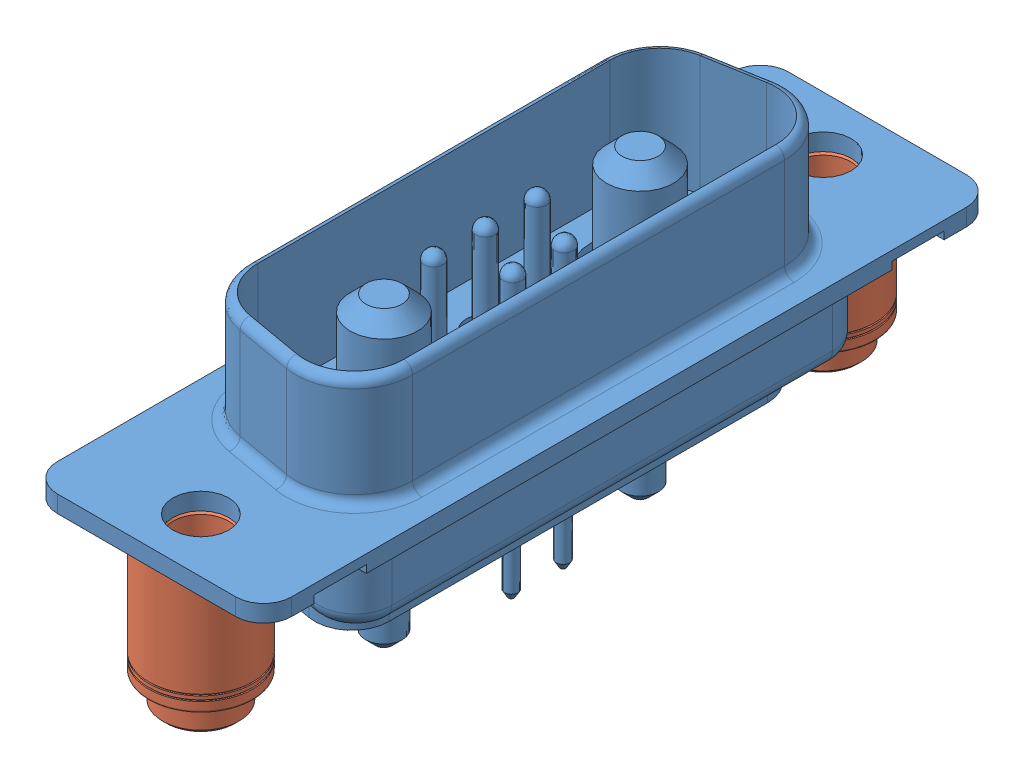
SolidWorks assembly CBD7W2 with SMT standoff.SLDASM, configuration Default (file format 11000). Lengths in mm.
Overall size (12.55 16.86 39.14).
3 component instances, 2 part files, 4 mates.
Components (placement in the parent):
- CBD7W2M35S6000-1: CBD7W2M35S6000.SLDPRT [without posts] at origin size (12.55 16.86 39.14)
- 20130118-183809-29217700-1: 20130118-183809-29217700.SLDPRT [Default] at (0 -7.874 16.6624) x (0 1 0) z (0 0 1) size (7.87 5.56 5.56)
- 20130118-183809-29217700-2: 20130118-183809-29217700.SLDPRT [Default] at (0 -7.874 -16.6624) x (0 1 0) z (0 0 1) size (7.87 5.56 5.56)
Mates (geometry in assembly coordinates):
- Coincident1: coincident: plane of CBD7W2M35S6000-1 through (4.7752 0 -18.0721) normal (0 -1 0); plane of 20130118-183809-29217700-1 through (2.7518 0 19.3603) normal (0 1 0)
- Concentric1: concentric: cylinder of CBD7W2M35S6000-1 through (0 6.9807 16.6624) axis (0 -1 0) radius 1.4986; cylinder of 20130118-183809-29217700-1 through (0 -0.1473 16.6624) axis (0 -1 0) radius 1.4732
- Concentric2: concentric: cylinder of CBD7W2M35S6000-1 through (0 6.9807 -16.6624) axis (0 -1 0) radius 1.4986; point of 20130118-183809-29217700-2
- Coincident3: coincident: plane of CBD7W2M35S6000-1 through (4.7752 0 -18.0721) normal (0 -1 0); plane of 20130118-183809-29217700-2 through (2.7518 0 -13.9645) normal (0 1 0)
